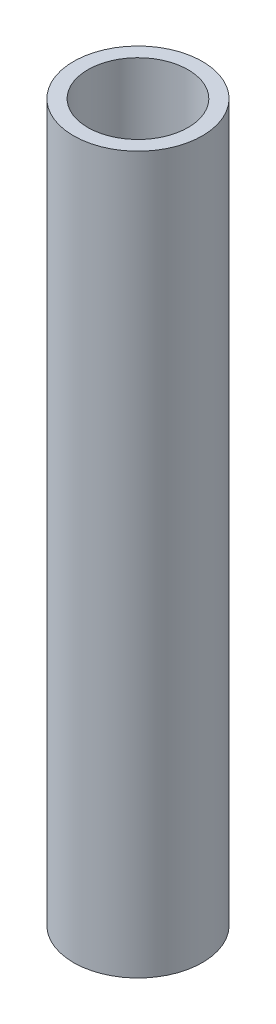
ISO-10303-21;
HEADER;
FILE_DESCRIPTION(('STEP AP214'),'2;1');
FILE_NAME('part.step','',(''),(''),'','','');
FILE_SCHEMA(('AUTOMOTIVE_DESIGN { 1 0 10303 214 1 1 1 1 }'));
ENDSEC;
DATA;
#1=APPLICATION_CONTEXT('core data for automotive mechanical design processes');
#2=APPLICATION_PROTOCOL_DEFINITION('international standard','automotive_design',2000,#1);
#3=PRODUCT_CONTEXT('',#1,'mechanical');
#4=PRODUCT('Part','Part','',(#3));
#5=PRODUCT_RELATED_PRODUCT_CATEGORY('part','',(#4));
#6=PRODUCT_DEFINITION_FORMATION('','',#4);
#7=PRODUCT_DEFINITION_CONTEXT('part definition',#1,'design');
#8=PRODUCT_DEFINITION('design','',#6,#7);
#9=PRODUCT_DEFINITION_SHAPE('','',#8);
#10=(LENGTH_UNIT() NAMED_UNIT(*) SI_UNIT(.MILLI.,.METRE.));
#11=(NAMED_UNIT(*) PLANE_ANGLE_UNIT() SI_UNIT($,.RADIAN.));
#12=(NAMED_UNIT(*) SI_UNIT($,.STERADIAN.) SOLID_ANGLE_UNIT());
#13=UNCERTAINTY_MEASURE_WITH_UNIT(LENGTH_MEASURE(1.E-05),#10,'distance_accuracy_value','');
#14=(GEOMETRIC_REPRESENTATION_CONTEXT(3) GLOBAL_UNCERTAINTY_ASSIGNED_CONTEXT((#13)) GLOBAL_UNIT_ASSIGNED_CONTEXT((#10,
#11,#12)) REPRESENTATION_CONTEXT('',''));
#15=CARTESIAN_POINT('',(0.,0.,0.));
#16=DIRECTION('',(0.,0.,1.));
#17=DIRECTION('',(1.,0.,0.));
#18=AXIS2_PLACEMENT_3D('',#15,#16,#17);
#19=CARTESIAN_POINT('',(0.,50.,0.));
#20=DIRECTION('',(0.,1.,0.));
#21=DIRECTION('',(0.,0.,1.));
#22=AXIS2_PLACEMENT_3D('',#19,#20,#21);
#23=PLANE('',#22);
#24=CARTESIAN_POINT('',(0.,50.,0.));
#25=DIRECTION('',(0.,1.,0.));
#26=DIRECTION('',(0.,0.,1.));
#27=AXIS2_PLACEMENT_3D('',#24,#25,#26);
#28=CIRCLE('',#27,4.5);
#29=CARTESIAN_POINT('',(0.,50.,4.5));
#30=VERTEX_POINT('',#29);
#31=EDGE_CURVE('E10',#30,#30,#28,.T.);
#32=ORIENTED_EDGE('',*,*,#31,.T.);
#33=EDGE_LOOP('',(#32));
#34=FACE_BOUND('',#33,.T.);
#35=CARTESIAN_POINT('',(0.,50.,0.));
#36=DIRECTION('',(0.,1.,0.));
#37=DIRECTION('',(0.,0.,1.));
#38=AXIS2_PLACEMENT_3D('',#35,#36,#37);
#39=CIRCLE('',#38,3.5);
#40=CARTESIAN_POINT('',(0.,50.,3.5));
#41=VERTEX_POINT('',#40);
#42=EDGE_CURVE('E58',#41,#41,#39,.T.);
#43=ORIENTED_EDGE('',*,*,#42,.F.);
#44=EDGE_LOOP('',(#43));
#45=FACE_BOUND('',#44,.T.);
#46=ADVANCED_FACE('F45',(#34,#45),#23,.T.);
#47=CARTESIAN_POINT('',(0.,0.,0.));
#48=DIRECTION('',(0.,1.,0.));
#49=DIRECTION('',(0.,0.,1.));
#50=AXIS2_PLACEMENT_3D('',#47,#48,#49);
#51=PLANE('',#50);
#52=CARTESIAN_POINT('',(0.,0.,0.));
#53=DIRECTION('',(0.,1.,0.));
#54=DIRECTION('',(0.,0.,1.));
#55=AXIS2_PLACEMENT_3D('',#52,#53,#54);
#56=CIRCLE('',#55,4.5);
#57=CARTESIAN_POINT('',(0.,0.,4.5));
#58=VERTEX_POINT('',#57);
#59=EDGE_CURVE('E49',#58,#58,#56,.T.);
#60=ORIENTED_EDGE('',*,*,#59,.F.);
#61=EDGE_LOOP('',(#60));
#62=FACE_BOUND('',#61,.T.);
#63=CARTESIAN_POINT('',(0.,0.,0.));
#64=DIRECTION('',(0.,1.,0.));
#65=DIRECTION('',(0.,0.,1.));
#66=AXIS2_PLACEMENT_3D('',#63,#64,#65);
#67=CIRCLE('',#66,3.5);
#68=CARTESIAN_POINT('',(0.,0.,3.5));
#69=VERTEX_POINT('',#68);
#70=EDGE_CURVE('E60',#69,#69,#67,.T.);
#71=ORIENTED_EDGE('',*,*,#70,.T.);
#72=EDGE_LOOP('',(#71));
#73=FACE_BOUND('',#72,.T.);
#74=ADVANCED_FACE('F72',(#62,#73),#51,.F.);
#75=CARTESIAN_POINT('',(0.,50.,0.));
#76=DIRECTION('',(0.,-1.,0.));
#77=DIRECTION('',(0.,0.,-1.));
#78=AXIS2_PLACEMENT_3D('',#75,#76,#77);
#79=CYLINDRICAL_SURFACE('',#78,4.5);
#80=ORIENTED_EDGE('',*,*,#31,.F.);
#81=EDGE_LOOP('',(#80));
#82=FACE_BOUND('',#81,.T.);
#83=ORIENTED_EDGE('',*,*,#59,.T.);
#84=EDGE_LOOP('',(#83));
#85=FACE_BOUND('',#84,.T.);
#86=ADVANCED_FACE('F47',(#82,#85),#79,.T.);
#87=CARTESIAN_POINT('',(0.,50.,0.));
#88=DIRECTION('',(0.,-1.,0.));
#89=DIRECTION('',(0.,0.,-1.));
#90=AXIS2_PLACEMENT_3D('',#87,#88,#89);
#91=CYLINDRICAL_SURFACE('',#90,3.5);
#92=ORIENTED_EDGE('',*,*,#42,.T.);
#93=EDGE_LOOP('',(#92));
#94=FACE_BOUND('',#93,.T.);
#95=ORIENTED_EDGE('',*,*,#70,.F.);
#96=EDGE_LOOP('',(#95));
#97=FACE_BOUND('',#96,.T.);
#98=ADVANCED_FACE('F68',(#94,#97),#91,.F.);
#99=CLOSED_SHELL('',(#46,#74,#86,#98));
#100=MANIFOLD_SOLID_BREP('B2',#99);
#101=ADVANCED_BREP_SHAPE_REPRESENTATION('',(#18,#100),#14);
#102=SHAPE_DEFINITION_REPRESENTATION(#9,#101);
ENDSEC;
END-ISO-10303-21;
